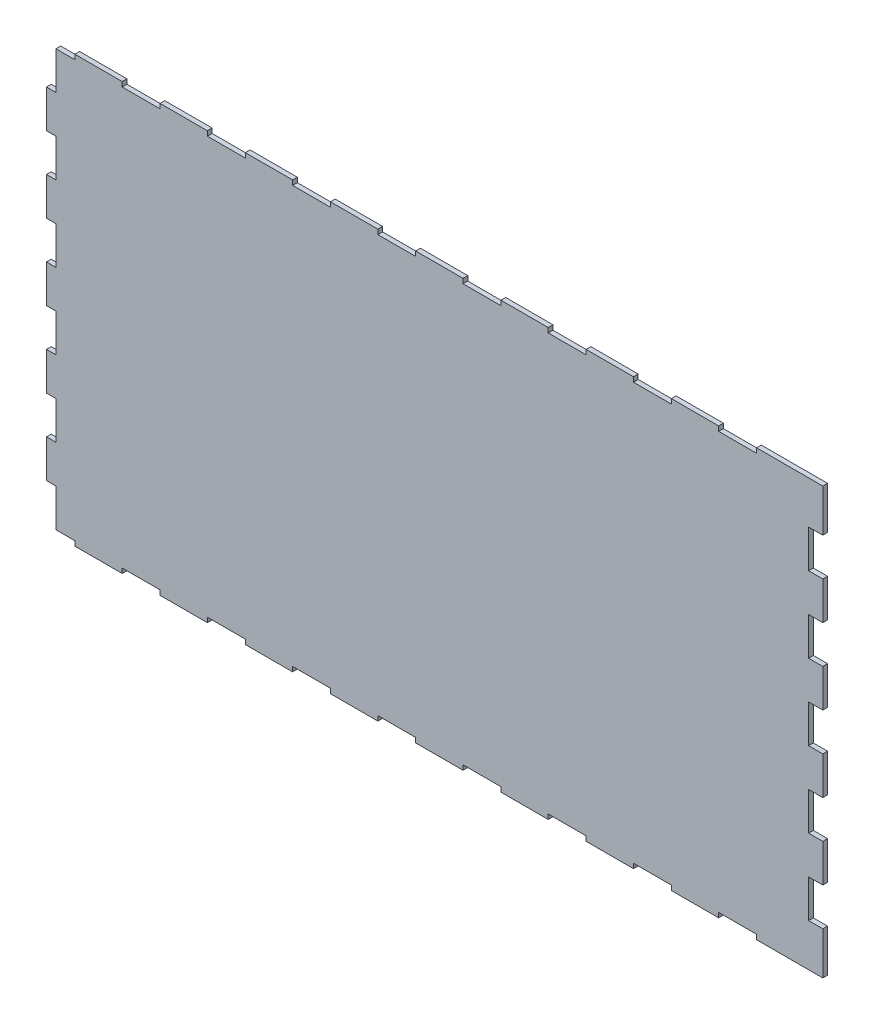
from build123d import *

# Parameters (mm, degrees)
BOSS_EXTRUDE1_DEPTH = 5
CUT_EXTRUDE1_DEPTH  = 928.712239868


with BuildPart() as part:
    # Model → Boss-Extrude1 (new body)
    with BuildSketch(Plane.XY):
        Polygon((900, 180), (885, 180), (885, 140), (900, 140), (900, 100), (885, 100), (885, 60), (900, 60), (900, 20), (885, 20), (885, -20), (900, -20), (900, -60), (885, -60), (885, -100), (900, -100), (900, -140), (885, -140), (885, -180), (900, -180), (900, -225), (830, -225), (830, -220), (790, -220), (790, -225), (740, -225), (740, -220), (700, -220), (700, -225), (650, -225), (650, -220), (610, -220), (610, -225), (560, -225), (560, -220), (520, -220), (520, -225), (470, -225), (470, -220), (430, -220), (430, -225), (380, -225), (380, -220), (340, -220), (340, -225), (290, -225), (290, -220), (250, -220), (250, -225), (200, -225), (200, -220), (160, -220), (160, -225), (110, -225), (110, -220), (70, -220), (70, -225), (20, -225), (20, -220), (-20, -220), (-20, -225), (-70, -225), (-70, -220), (-110, -220), (-110, -225), (-160, -225), (-160, -220), (-200, -220), (-200, -225), (-250, -225), (-250, -220), (-290, -220), (-290, -225), (-340, -225), (-340, -220), (-380, -220), (-380, -225), (-430, -225), (-430, -220), (-470, -220), (-470, -225), (-520, -225), (-520, -220), (-560, -220), (-560, -225), (-610, -225), (-610, -220), (-650, -220), (-650, -225), (-700, -225), (-700, -220), (-740, -220), (-740, -225), (-790, -225), (-790, -220), (-830, -220), (-830, -225), (-900, -225), (-900, -180), (-885, -180), (-885, -140), (-900, -140), (-900, -100), (-885, -100), (-885, -60), (-900, -60), (-900, -20), (-885, -20), (-885, 20), (-900, 20), (-900, 60), (-885, 60), (-885, 100), (-900, 100), (-900, 140), (-885, 140), (-885, 180), (-900, 180), (-900, 225), (-830, 225), (-830, 220), (-790, 220), (-790, 225), (-740, 225), (-740, 220), (-700, 220), (-700, 225), (-650, 225), (-650, 220), (-610, 220), (-610, 225), (-560, 225), (-560, 220), (-520, 220), (-520, 225), (-470, 225), (-470, 220), (-430, 220), (-430, 225), (-380, 225), (-380, 220), (-340, 220), (-340, 225), (-290, 225), (-290, 220), (-250, 220), (-250, 225), (-200, 225), (-200, 220), (-160, 220), (-160, 225), (-110, 225), (-110, 220), (-70, 220), (-70, 225), (-20, 225), (-20, 220), (20, 220), (20, 225), (70, 225), (70, 220), (110, 220), (110, 225), (160, 225), (160, 220), (200, 220), (200, 225), (250, 225), (250, 220), (290, 220), (290, 225), (340, 225), (340, 220), (380, 220), (380, 225), (430, 225), (430, 220), (470, 220), (470, 225), (520, 225), (520, 220), (560, 220), (560, 225), (610, 225), (610, 220), (650, 220), (650, 225), (700, 225), (700, 220), (740, 220), (740, 225), (790, 225), (790, 220), (830, 220), (830, 225), (900, 225), align=None)
    extrude(amount=BOSS_EXTRUDE1_DEPTH)

    # Sketch1 → Cut-Extrude1 (cut, through all)
    with BuildSketch(Plane.XY.offset(5)):
        Polygon((90, 180), (90, 220), (-1055.896399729, 587.366724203), (-996.811738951, -716.868460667), (90, -220), (90, -180), (80, -180), (80, -140), (90, -140), (90, -100), (80, -100), (80, -60), (90, -60), (90, -20), (80, -20), (80, 20), (90, 20), (90, 60), (80, 60), (80, 100), (90, 100), (90, 140), (80, 140), (80, 180), align=None)
    extrude(amount=-CUT_EXTRUDE1_DEPTH, mode=Mode.SUBTRACT)


solid = part.part
